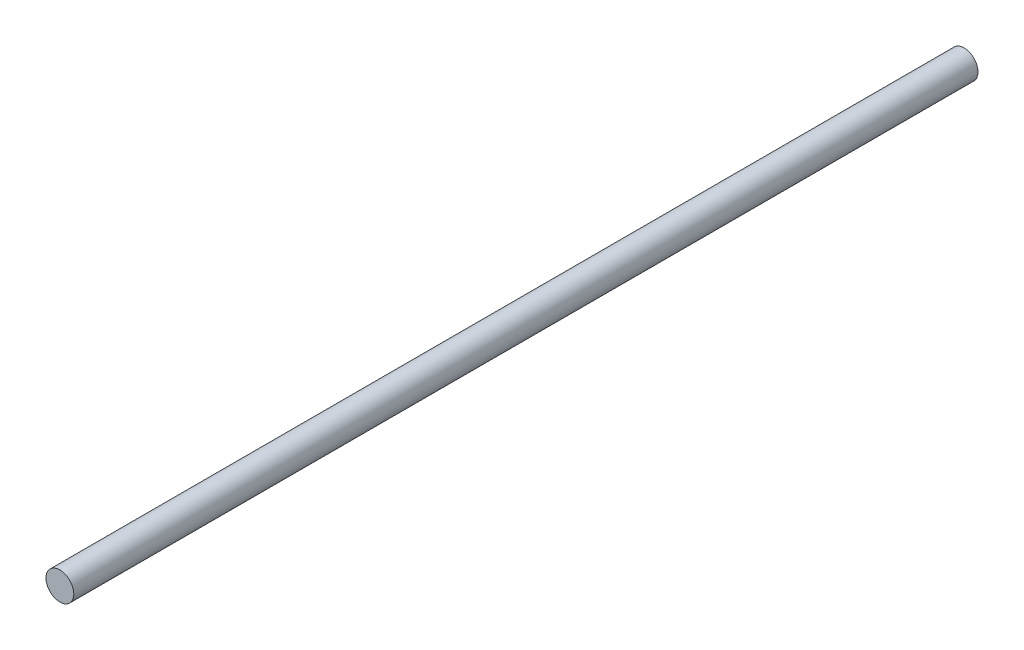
ISO-10303-21;
HEADER;
FILE_DESCRIPTION(('STEP AP214'),'2;1');
FILE_NAME('part.step','',(''),(''),'','','');
FILE_SCHEMA(('AUTOMOTIVE_DESIGN { 1 0 10303 214 1 1 1 1 }'));
ENDSEC;
DATA;
#1=APPLICATION_CONTEXT('core data for automotive mechanical design processes');
#2=APPLICATION_PROTOCOL_DEFINITION('international standard','automotive_design',2000,#1);
#3=PRODUCT_CONTEXT('',#1,'mechanical');
#4=PRODUCT('Part','Part','',(#3));
#5=PRODUCT_RELATED_PRODUCT_CATEGORY('part','',(#4));
#6=PRODUCT_DEFINITION_FORMATION('','',#4);
#7=PRODUCT_DEFINITION_CONTEXT('part definition',#1,'design');
#8=PRODUCT_DEFINITION('design','',#6,#7);
#9=PRODUCT_DEFINITION_SHAPE('','',#8);
#10=(LENGTH_UNIT() NAMED_UNIT(*) SI_UNIT(.MILLI.,.METRE.));
#11=(NAMED_UNIT(*) PLANE_ANGLE_UNIT() SI_UNIT($,.RADIAN.));
#12=(NAMED_UNIT(*) SI_UNIT($,.STERADIAN.) SOLID_ANGLE_UNIT());
#13=UNCERTAINTY_MEASURE_WITH_UNIT(LENGTH_MEASURE(1.E-05),#10,'distance_accuracy_value','');
#14=(GEOMETRIC_REPRESENTATION_CONTEXT(3) GLOBAL_UNCERTAINTY_ASSIGNED_CONTEXT((#13)) GLOBAL_UNIT_ASSIGNED_CONTEXT((#10,
#11,#12)) REPRESENTATION_CONTEXT('',''));
#15=CARTESIAN_POINT('',(0.,0.,0.));
#16=DIRECTION('',(0.,0.,1.));
#17=DIRECTION('',(1.,0.,0.));
#18=AXIS2_PLACEMENT_3D('',#15,#16,#17);
#19=CARTESIAN_POINT('',(0.,0.,-1950.));
#20=DIRECTION('',(0.,0.,1.));
#21=DIRECTION('',(1.,0.,0.));
#22=AXIS2_PLACEMENT_3D('',#19,#20,#21);
#23=CYLINDRICAL_SURFACE('',#22,30.);
#24=CARTESIAN_POINT('',(0.,0.,-1950.));
#25=DIRECTION('',(0.,0.,1.));
#26=DIRECTION('',(1.,0.,0.));
#27=AXIS2_PLACEMENT_3D('',#24,#25,#26);
#28=CIRCLE('',#27,30.);
#29=CARTESIAN_POINT('',(30.,0.,-1950.));
#30=VERTEX_POINT('',#29);
#31=EDGE_CURVE('E10',#30,#30,#28,.T.);
#32=ORIENTED_EDGE('',*,*,#31,.T.);
#33=EDGE_LOOP('',(#32));
#34=FACE_BOUND('',#33,.T.);
#35=CARTESIAN_POINT('',(0.,0.,0.));
#36=DIRECTION('',(0.,0.,1.));
#37=DIRECTION('',(1.,0.,0.));
#38=AXIS2_PLACEMENT_3D('',#35,#36,#37);
#39=CIRCLE('',#38,30.);
#40=CARTESIAN_POINT('',(30.,0.,0.));
#41=VERTEX_POINT('',#40);
#42=EDGE_CURVE('E40',#41,#41,#39,.T.);
#43=ORIENTED_EDGE('',*,*,#42,.F.);
#44=EDGE_LOOP('',(#43));
#45=FACE_BOUND('',#44,.T.);
#46=ADVANCED_FACE('F37',(#34,#45),#23,.T.);
#47=CARTESIAN_POINT('',(0.,0.,-1950.));
#48=DIRECTION('',(0.,0.,1.));
#49=DIRECTION('',(1.,0.,0.));
#50=AXIS2_PLACEMENT_3D('',#47,#48,#49);
#51=PLANE('',#50);
#52=ORIENTED_EDGE('',*,*,#31,.F.);
#53=EDGE_LOOP('',(#52));
#54=FACE_BOUND('',#53,.T.);
#55=ADVANCED_FACE('F54',(#54),#51,.F.);
#56=CARTESIAN_POINT('',(0.,0.,0.));
#57=DIRECTION('',(0.,0.,1.));
#58=DIRECTION('',(1.,0.,0.));
#59=AXIS2_PLACEMENT_3D('',#56,#57,#58);
#60=PLANE('',#59);
#61=ORIENTED_EDGE('',*,*,#42,.T.);
#62=EDGE_LOOP('',(#61));
#63=FACE_BOUND('',#62,.T.);
#64=ADVANCED_FACE('F51',(#63),#60,.T.);
#65=CLOSED_SHELL('',(#46,#55,#64));
#66=MANIFOLD_SOLID_BREP('B2',#65);
#67=ADVANCED_BREP_SHAPE_REPRESENTATION('',(#18,#66),#14);
#68=SHAPE_DEFINITION_REPRESENTATION(#9,#67);
ENDSEC;
END-ISO-10303-21;
